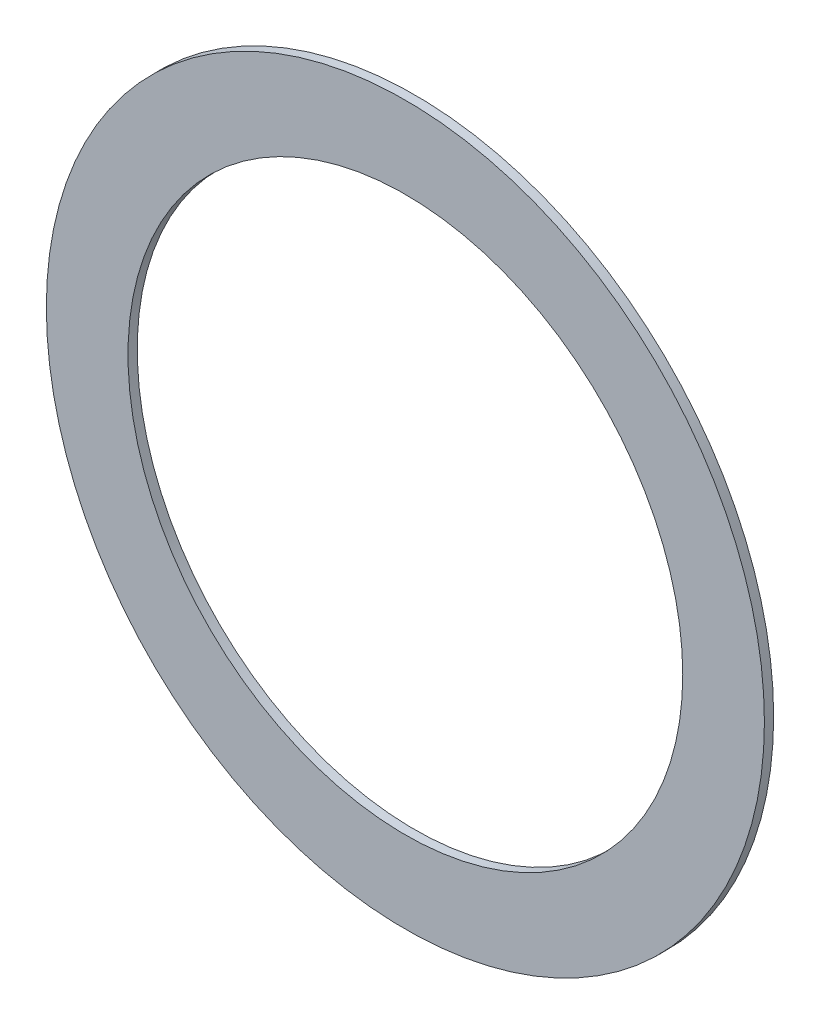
ISO-10303-21;
HEADER;
FILE_DESCRIPTION(('STEP AP214'),'2;1');
FILE_NAME('part.step','',(''),(''),'','','');
FILE_SCHEMA(('AUTOMOTIVE_DESIGN { 1 0 10303 214 1 1 1 1 }'));
ENDSEC;
DATA;
#1=APPLICATION_CONTEXT('core data for automotive mechanical design processes');
#2=APPLICATION_PROTOCOL_DEFINITION('international standard','automotive_design',2000,#1);
#3=PRODUCT_CONTEXT('',#1,'mechanical');
#4=PRODUCT('Part','Part','',(#3));
#5=PRODUCT_RELATED_PRODUCT_CATEGORY('part','',(#4));
#6=PRODUCT_DEFINITION_FORMATION('','',#4);
#7=PRODUCT_DEFINITION_CONTEXT('part definition',#1,'design');
#8=PRODUCT_DEFINITION('design','',#6,#7);
#9=PRODUCT_DEFINITION_SHAPE('','',#8);
#10=(LENGTH_UNIT() NAMED_UNIT(*) SI_UNIT(.MILLI.,.METRE.));
#11=(NAMED_UNIT(*) PLANE_ANGLE_UNIT() SI_UNIT($,.RADIAN.));
#12=(NAMED_UNIT(*) SI_UNIT($,.STERADIAN.) SOLID_ANGLE_UNIT());
#13=UNCERTAINTY_MEASURE_WITH_UNIT(LENGTH_MEASURE(1.E-05),#10,'distance_accuracy_value','');
#14=(GEOMETRIC_REPRESENTATION_CONTEXT(3) GLOBAL_UNCERTAINTY_ASSIGNED_CONTEXT((#13)) GLOBAL_UNIT_ASSIGNED_CONTEXT((#10,
#11,#12)) REPRESENTATION_CONTEXT('',''));
#15=CARTESIAN_POINT('',(0.,0.,0.));
#16=DIRECTION('',(0.,0.,1.));
#17=DIRECTION('',(1.,0.,0.));
#18=AXIS2_PLACEMENT_3D('',#15,#16,#17);
#19=CARTESIAN_POINT('',(0.,0.,332.511760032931));
#20=DIRECTION('',(0.,0.,-1.));
#21=DIRECTION('',(-1.,0.,0.));
#22=AXIS2_PLACEMENT_3D('',#19,#20,#21);
#23=CYLINDRICAL_SURFACE('',#22,116.5);
#24=CARTESIAN_POINT('',(0.,0.,0.));
#25=DIRECTION('',(0.,0.,1.));
#26=DIRECTION('',(1.,0.,0.));
#27=AXIS2_PLACEMENT_3D('',#24,#25,#26);
#28=CIRCLE('',#27,116.5);
#29=CARTESIAN_POINT('',(116.5,0.,0.));
#30=VERTEX_POINT('',#29);
#31=EDGE_CURVE('E44',#30,#30,#28,.T.);
#32=ORIENTED_EDGE('',*,*,#31,.T.);
#33=EDGE_LOOP('',(#32));
#34=FACE_BOUND('',#33,.T.);
#35=CARTESIAN_POINT('',(0.,0.,3.));
#36=DIRECTION('',(0.,0.,1.));
#37=DIRECTION('',(1.,0.,0.));
#38=AXIS2_PLACEMENT_3D('',#35,#36,#37);
#39=CIRCLE('',#38,116.5);
#40=CARTESIAN_POINT('',(116.5,0.,3.));
#41=VERTEX_POINT('',#40);
#42=EDGE_CURVE('E10',#41,#41,#39,.T.);
#43=ORIENTED_EDGE('',*,*,#42,.F.);
#44=EDGE_LOOP('',(#43));
#45=FACE_BOUND('',#44,.T.);
#46=ADVANCED_FACE('F37',(#34,#45),#23,.T.);
#47=CARTESIAN_POINT('',(0.,0.,0.));
#48=DIRECTION('',(0.,0.,1.));
#49=DIRECTION('',(1.,0.,0.));
#50=AXIS2_PLACEMENT_3D('',#47,#48,#49);
#51=PLANE('',#50);
#52=ORIENTED_EDGE('',*,*,#31,.F.);
#53=EDGE_LOOP('',(#52));
#54=FACE_BOUND('',#53,.T.);
#55=CARTESIAN_POINT('',(0.,0.,0.));
#56=DIRECTION('',(0.,0.,1.));
#57=DIRECTION('',(1.,0.,0.));
#58=AXIS2_PLACEMENT_3D('',#55,#56,#57);
#59=CIRCLE('',#58,90.);
#60=CARTESIAN_POINT('',(90.,0.,0.));
#61=VERTEX_POINT('',#60);
#62=EDGE_CURVE('E49',#61,#61,#59,.T.);
#63=ORIENTED_EDGE('',*,*,#62,.T.);
#64=EDGE_LOOP('',(#63));
#65=FACE_BOUND('',#64,.T.);
#66=ADVANCED_FACE('F65',(#54,#65),#51,.F.);
#67=CARTESIAN_POINT('',(0.,0.,332.511760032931));
#68=DIRECTION('',(0.,0.,-1.));
#69=DIRECTION('',(-1.,0.,0.));
#70=AXIS2_PLACEMENT_3D('',#67,#68,#69);
#71=CYLINDRICAL_SURFACE('',#70,90.);
#72=ORIENTED_EDGE('',*,*,#62,.F.);
#73=EDGE_LOOP('',(#72));
#74=FACE_BOUND('',#73,.T.);
#75=CARTESIAN_POINT('',(0.,0.,3.));
#76=DIRECTION('',(0.,0.,1.));
#77=DIRECTION('',(1.,0.,0.));
#78=AXIS2_PLACEMENT_3D('',#75,#76,#77);
#79=CIRCLE('',#78,90.);
#80=CARTESIAN_POINT('',(90.,0.,3.));
#81=VERTEX_POINT('',#80);
#82=EDGE_CURVE('E40',#81,#81,#79,.T.);
#83=ORIENTED_EDGE('',*,*,#82,.T.);
#84=EDGE_LOOP('',(#83));
#85=FACE_BOUND('',#84,.T.);
#86=ADVANCED_FACE('F57',(#74,#85),#71,.F.);
#87=CARTESIAN_POINT('',(0.,0.,3.));
#88=DIRECTION('',(0.,0.,1.));
#89=DIRECTION('',(1.,0.,0.));
#90=AXIS2_PLACEMENT_3D('',#87,#88,#89);
#91=PLANE('',#90);
#92=ORIENTED_EDGE('',*,*,#82,.F.);
#93=EDGE_LOOP('',(#92));
#94=FACE_BOUND('',#93,.T.);
#95=ORIENTED_EDGE('',*,*,#42,.T.);
#96=EDGE_LOOP('',(#95));
#97=FACE_BOUND('',#96,.T.);
#98=ADVANCED_FACE('F59',(#94,#97),#91,.T.);
#99=CLOSED_SHELL('',(#46,#66,#86,#98));
#100=MANIFOLD_SOLID_BREP('B2',#99);
#101=ADVANCED_BREP_SHAPE_REPRESENTATION('',(#18,#100),#14);
#102=SHAPE_DEFINITION_REPRESENTATION(#9,#101);
ENDSEC;
END-ISO-10303-21;
